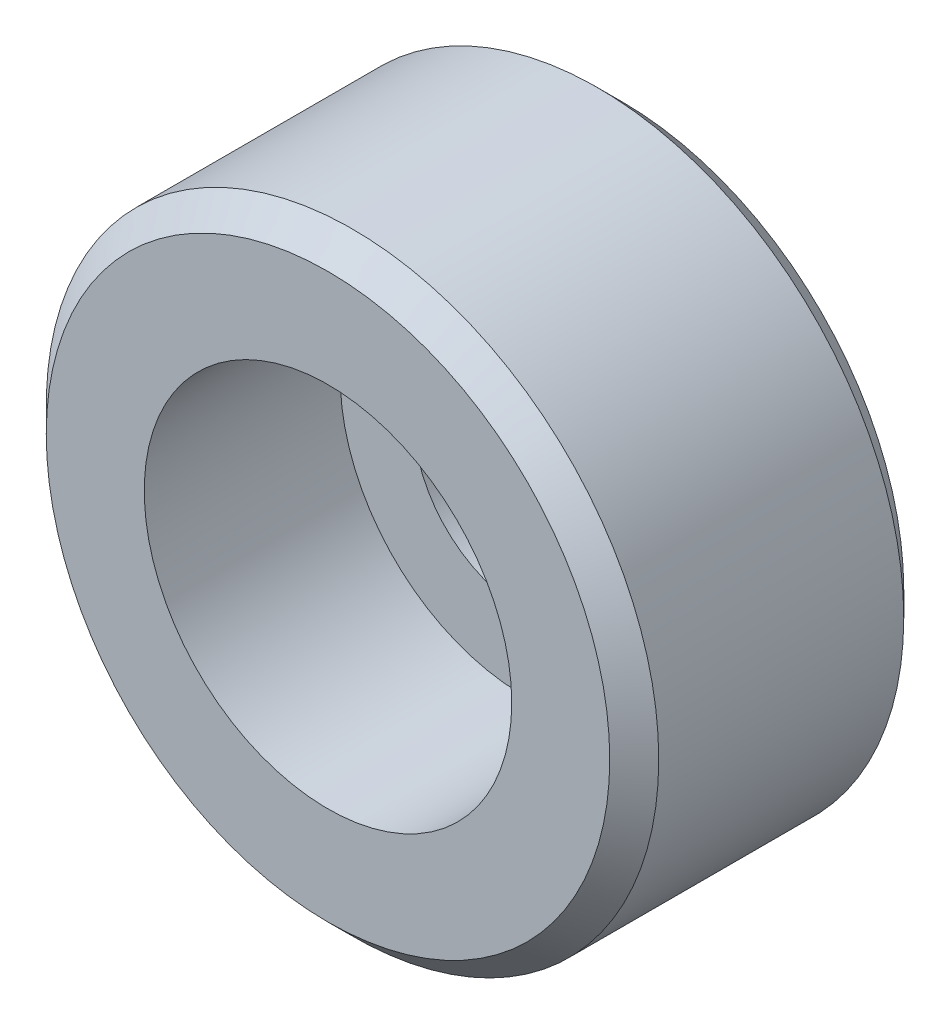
from build123d import *

# Parameters (mm, degrees)
SKETCH_1_R                   = 12.5
EXTRUDE_1_DEPTH              = 12
HOLE_WIZARD_M8_1_D           = 9
HOLE_WIZARD_M8_1_CBORE_D     = 15
HOLE_WIZARD_M8_1_CBORE_DEPTH = 8
CHAMFER_1_SIZE               = 1


with BuildPart() as part:
    # Sketch 1 → Extrude 1 (new body)
    with BuildSketch(Plane.XY):
        Circle(SKETCH_1_R)
    extrude(amount=EXTRUDE_1_DEPTH)

    # Hole Wizard M8 _1 (through all)
    with Locations(Plane.XY.offset(12)):
        with Locations((0, 0)):
            CounterBoreHole(HOLE_WIZARD_M8_1_D / 2, HOLE_WIZARD_M8_1_CBORE_D / 2, HOLE_WIZARD_M8_1_CBORE_DEPTH)

    # Chamfer 1
    chamfer_1_edges = [part.edges().sort_by_distance(p)[0] for p in [
        (-12.5, 0, 0),
        (-12.5, 0, 12),
    ]]
    chamfer(chamfer_1_edges, length=CHAMFER_1_SIZE)


solid = part.part
